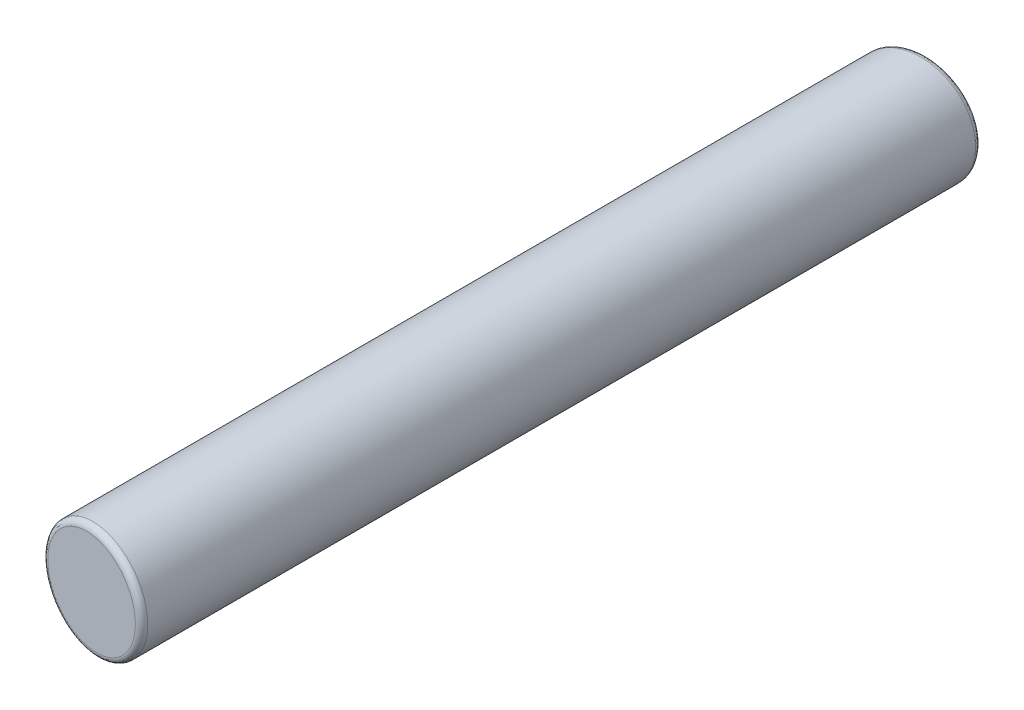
from build123d import *

# Parameters (mm, degrees)
SKETCH1_R           = 1.2065
BOSS_EXTRUDE1_DEPTH = 18.2372
CUT_EXTRUDE1_DEPTH  = 63.5
CUT_EXTRUDE2_DEPTH  = 63.5
FILLET1_R           = 0.127


with BuildPart() as part:
    # Sketch1 → Boss-Extrude1 (new body)
    with BuildSketch(Plane.XY):
        with Locations(Location((0, 0, 0), (0, 0, 180))):
            Circle(SKETCH1_R)
    extrude(amount=BOSS_EXTRUDE1_DEPTH)

    # Sketch2 → Cut-Extrude1 (cut, symmetric)
    with BuildSketch(Plane(origin=(0, 0, 0), x_dir=(1, 0, 0), z_dir=(0, 1, 0))):
        Polygon((1.2065, -18.2372), (-1.451990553, -17.917472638), (-1.142540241, -18.471225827), (1.300488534, -18.389791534), align=None)
    extrude(amount=CUT_EXTRUDE1_DEPTH, both=True, mode=Mode.SUBTRACT)

    # Sketch3 → Cut-Extrude2 (cut, symmetric)
    with BuildSketch(Plane(origin=(0, 0, 0), x_dir=(1, 0, 0), z_dir=(0, 1, 0))):
        Polygon((-1.2065, -0.2794), (1.2065, 0), (1.2065, 0.417373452), (-1.629190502, 0.417373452), (-1.629190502, -0.2794), align=None)
    extrude(amount=CUT_EXTRUDE2_DEPTH, both=True, mode=Mode.SUBTRACT)

    # Fillet1
    fillet1_edges = [part.edges().sort_by_distance(p)[0] for p in [
        (1e-09, 1.2065, 0.1397),
        (1e-09, 1.2065, 18.092098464),
    ]]
    fillet(fillet1_edges, radius=FILLET1_R)


solid = part.part
